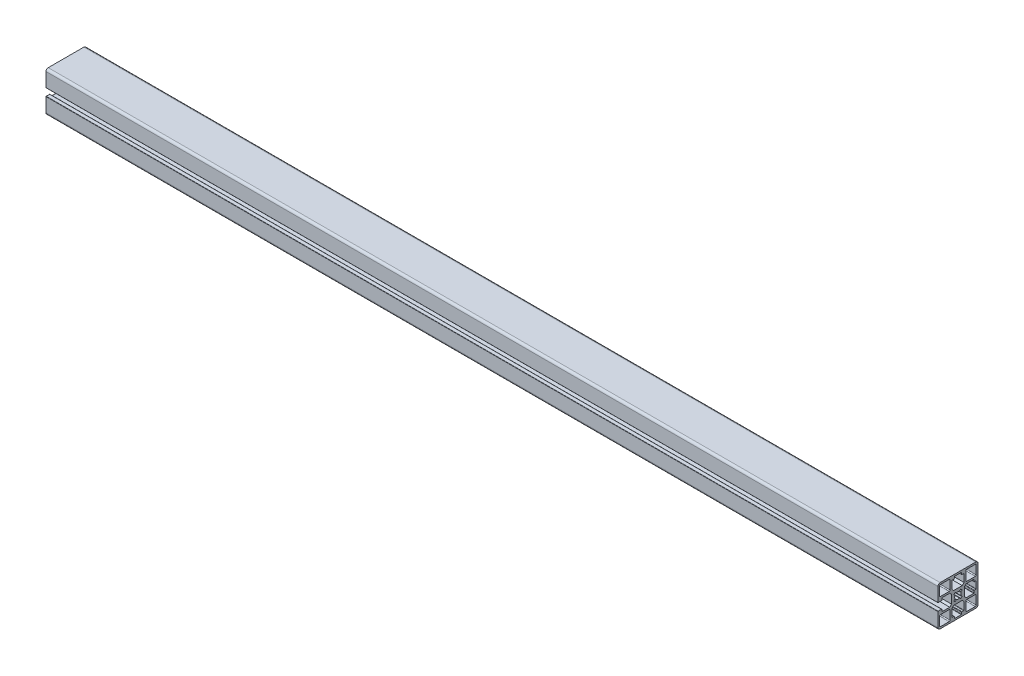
from build123d import *

# Parameters (mm, degrees)
F_45_SARJA_1_0174_45X45_L_3SS_VAHV_1_DEPTH = 1000


with BuildPart() as part:
    # Model → 45-sarja 1.0174 45X45 L 3SS VAHV_1 (new body)
    with BuildSketch(Plane(origin=(0, 0, 0), x_dir=(0, 0, 1), z_dir=(1, 0, 0))):
        with BuildLine():
            Line((-22.5, 20), (-22.5, 4.4))
            Line((-22.5, 4.4), (-22.5, -20))
            ThreePointArc((-22.5, -20), (-21.767766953, -21.767766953), (-20, -22.5))
            Line((-20, -22.5), (20, -22.5))
            ThreePointArc((20, -22.5), (21.767766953, -21.767766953), (22.5, -20))
            Line((22.5, -20), (22.5, -4.4))
            ThreePointArc((22.5, -4.4), (22.412132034, -4.187867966), (22.2, -4.1))
            Line((22.2, -4.1), (18.5, -4.1))
            ThreePointArc((18.5, -4.1), (18.146446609, -4.246446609), (18, -4.6))
            Line((18, -4.6), (18, -6.5))
            ThreePointArc((18, -6.5), (17.912132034, -6.712132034), (17.7, -6.8))
            Line((17.7, -6.8), (9.2, -6.8))
            Line((9.2, -6.8), (7.2, -4.8))
            Line((7.2, -4.8), (7.2, 4.8))
            Line((7.2, 4.8), (9.2, 6.8))
            Line((9.2, 6.8), (17.7, 6.8))
            ThreePointArc((17.7, 6.8), (17.912132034, 6.712132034), (18, 6.5))
            Line((18, 6.5), (18, 4.6))
            ThreePointArc((18, 4.6), (18.146446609, 4.246446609), (18.5, 4.1))
            Line((18.5, 4.1), (22.2, 4.1))
            ThreePointArc((22.2, 4.1), (22.412132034, 4.187867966), (22.5, 4.4))
            Line((22.5, 4.4), (22.5, 20))
            ThreePointArc((22.5, 20), (21.767766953, 21.767766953), (20, 22.5))
            Line((20, 22.5), (-20, 22.5))
            ThreePointArc((-20, 22.5), (-21.767766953, 21.767766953), (-22.5, 20))
        make_face()
        with BuildLine():
            Line((6.5, 18), (4.6, 18))
            ThreePointArc((4.6, 18), (4.246446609, 18.146446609), (4.1, 18.5))
            Line((4.1, 18.5), (4.1, 20.2))
            ThreePointArc((4.1, 20.2), (4.012132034, 20.412132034), (3.8, 20.5))
            Line((3.8, 20.5), (-3.8, 20.5))
            ThreePointArc((-3.8, 20.5), (-4.012132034, 20.412132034), (-4.1, 20.2))
            Line((-4.1, 20.2), (-4.1, 18.5))
            ThreePointArc((-4.1, 18.5), (-4.246446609, 18.146446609), (-4.6, 18))
            Line((-4.6, 18), (-6.5, 18))
            ThreePointArc((-6.5, 18), (-6.712132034, 17.912132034), (-6.8, 17.7))
            Line((-6.8, 17.7), (-6.8, 9.2))
            Line((-6.8, 9.2), (-4.8, 7.2))
            Line((-4.8, 7.2), (4.8, 7.2))
            Line((4.8, 7.2), (6.8, 9.2))
            Line((6.8, 9.2), (6.8, 17.7))
            ThreePointArc((6.8, 17.7), (6.712132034, 17.912132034), (6.5, 18))
        make_face(mode=Mode.SUBTRACT)
        with BuildLine():
            Line((-3.8, -20.5), (3.8, -20.5))
            ThreePointArc((3.8, -20.5), (4.012132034, -20.412132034), (4.1, -20.2))
            Line((4.1, -20.2), (4.1, -18.5))
            ThreePointArc((4.1, -18.5), (4.246446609, -18.146446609), (4.6, -18))
            Line((4.6, -18), (6.5, -18))
            ThreePointArc((6.5, -18), (6.712132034, -17.912132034), (6.8, -17.7))
            Line((6.8, -17.7), (6.8, -9.2))
            Line((6.8, -9.2), (4.8, -7.2))
            Line((4.8, -7.2), (-4.8, -7.2))
            Line((-4.8, -7.2), (-6.8, -9.2))
            Line((-6.8, -9.2), (-6.8, -17.7))
            ThreePointArc((-6.8, -17.7), (-6.712132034, -17.912132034), (-6.5, -18))
            Line((-6.5, -18), (-4.6, -18))
            ThreePointArc((-4.6, -18), (-4.246446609, -18.146446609), (-4.1, -18.5))
            Line((-4.1, -18.5), (-4.1, -20.2))
            ThreePointArc((-4.1, -20.2), (-4.012132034, -20.412132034), (-3.8, -20.5))
        make_face(mode=Mode.SUBTRACT)
        with BuildLine():
            Line((9.8, -20.5), (19.5, -20.5))
            ThreePointArc((19.5, -20.5), (20.207106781, -20.207106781), (20.5, -19.5))
            Line((20.5, -19.5), (20.5, -9.8))
            ThreePointArc((20.5, -9.8), (20.207106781, -9.092893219), (19.5, -8.8))
            Line((19.5, -8.8), (9.8, -8.8))
            ThreePointArc((9.8, -8.8), (9.092893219, -9.092893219), (8.8, -9.8))
            Line((8.8, -9.8), (8.8, -19.5))
            ThreePointArc((8.8, -19.5), (9.092893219, -20.207106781), (9.8, -20.5))
        make_face(mode=Mode.SUBTRACT)
        with BuildLine():
            Line((-20.5, -9.8), (-20.5, -19.5))
            ThreePointArc((-20.5, -19.5), (-20.207106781, -20.207106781), (-19.5, -20.5))
            Line((-19.5, -20.5), (-9.8, -20.5))
            ThreePointArc((-9.8, -20.5), (-9.092893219, -20.207106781), (-8.8, -19.5))
            Line((-8.8, -19.5), (-8.8, -9.8))
            ThreePointArc((-8.8, -9.8), (-9.092893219, -9.092893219), (-9.8, -8.8))
            Line((-9.8, -8.8), (-19.5, -8.8))
            ThreePointArc((-19.5, -8.8), (-20.207106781, -9.092893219), (-20.5, -9.8))
        make_face(mode=Mode.SUBTRACT)
        with BuildLine():
            Line((20.5, 9.8), (20.5, 19.5))
            ThreePointArc((20.5, 19.5), (20.207106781, 20.207106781), (19.5, 20.5))
            Line((19.5, 20.5), (9.8, 20.5))
            ThreePointArc((9.8, 20.5), (9.092893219, 20.207106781), (8.8, 19.5))
            Line((8.8, 19.5), (8.8, 9.8))
            ThreePointArc((8.8, 9.8), (9.092893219, 9.092893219), (9.8, 8.8))
            Line((9.8, 8.8), (19.5, 8.8))
            ThreePointArc((19.5, 8.8), (20.207106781, 9.092893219), (20.5, 9.8))
        make_face(mode=Mode.SUBTRACT)
        with BuildLine():
            Line((-9.8, 20.5), (-19.5, 20.5))
            ThreePointArc((-19.5, 20.5), (-20.207106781, 20.207106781), (-20.5, 19.5))
            Line((-20.5, 19.5), (-20.5, 9.8))
            ThreePointArc((-20.5, 9.8), (-20.207106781, 9.092893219), (-19.5, 8.8))
            Line((-19.5, 8.8), (-9.8, 8.8))
            ThreePointArc((-9.8, 8.8), (-9.092893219, 9.092893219), (-8.8, 9.8))
            Line((-8.8, 9.8), (-8.8, 19.5))
            ThreePointArc((-8.8, 19.5), (-9.092893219, 20.207106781), (-9.8, 20.5))
        make_face(mode=Mode.SUBTRACT)
        with BuildLine():
            Line((3.363290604, 1.949077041), (4.384062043, 2.969848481))
            ThreePointArc((4.384062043, 2.969848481), (4.471930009, 3.181980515), (4.384062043, 3.39411255))
            Line((4.384062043, 3.39411255), (3.39411255, 4.384062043))
            ThreePointArc((3.39411255, 4.384062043), (3.181980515, 4.471930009), (2.969848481, 4.384062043))
            Line((2.969848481, 4.384062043), (1.949077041, 3.363290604))
            ThreePointArc((1.949077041, 3.363290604), (1.786690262, 3.279575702), (1.605854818, 3.30557942))
            ThreePointArc((1.605854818, 3.30557942), (0, 3.675), (-1.605854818, 3.30557942))
            ThreePointArc((-1.605854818, 3.30557942), (-1.786690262, 3.279575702), (-1.949077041, 3.363290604))
            Line((-1.949077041, 3.363290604), (-2.969848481, 4.384062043))
            ThreePointArc((-2.969848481, 4.384062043), (-3.181980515, 4.471930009), (-3.39411255, 4.384062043))
            Line((-3.39411255, 4.384062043), (-4.384062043, 3.39411255))
            ThreePointArc((-4.384062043, 3.39411255), (-4.471930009, 3.181980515), (-4.384062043, 2.969848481))
            Line((-4.384062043, 2.969848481), (-3.363290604, 1.949077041))
            ThreePointArc((-3.363290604, 1.949077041), (-3.279575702, 1.786690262), (-3.30557942, 1.605854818))
            ThreePointArc((-3.30557942, 1.605854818), (-3.675, 0), (-3.30557942, -1.605854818))
            ThreePointArc((-3.30557942, -1.605854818), (-3.279575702, -1.786690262), (-3.363290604, -1.949077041))
            Line((-3.363290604, -1.949077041), (-4.384062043, -2.969848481))
            ThreePointArc((-4.384062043, -2.969848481), (-4.471930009, -3.181980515), (-4.384062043, -3.39411255))
            Line((-4.384062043, -3.39411255), (-3.39411255, -4.384062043))
            ThreePointArc((-3.39411255, -4.384062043), (-3.181980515, -4.471930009), (-2.969848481, -4.384062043))
            Line((-2.969848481, -4.384062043), (-1.949077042, -3.363290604))
            ThreePointArc((-1.949077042, -3.363290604), (-1.786690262, -3.279575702), (-1.605854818, -3.30557942))
            ThreePointArc((-1.605854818, -3.30557942), (0, -3.675), (1.605854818, -3.30557942))
            ThreePointArc((1.605854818, -3.30557942), (1.786690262, -3.279575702), (1.949077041, -3.363290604))
            Line((1.949077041, -3.363290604), (2.969848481, -4.384062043))
            ThreePointArc((2.969848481, -4.384062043), (3.181980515, -4.471930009), (3.39411255, -4.384062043))
            Line((3.39411255, -4.384062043), (4.384062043, -3.39411255))
            ThreePointArc((4.384062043, -3.39411255), (4.471930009, -3.181980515), (4.384062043, -2.969848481))
            Line((4.384062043, -2.969848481), (3.363290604, -1.949077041))
            ThreePointArc((3.363290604, -1.949077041), (3.279575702, -1.786690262), (3.30557942, -1.605854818))
            ThreePointArc((3.30557942, -1.605854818), (3.675, 0), (3.30557942, 1.605854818))
            ThreePointArc((3.30557942, 1.605854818), (3.279575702, 1.786690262), (3.363290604, 1.949077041))
        make_face(mode=Mode.SUBTRACT)
        with BuildLine():
            Line((-20.5, 3.8), (-20.5, -3.8))
            ThreePointArc((-20.5, -3.8), (-20.412132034, -4.012132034), (-20.2, -4.1))
            Line((-20.2, -4.1), (-18.5, -4.1))
            ThreePointArc((-18.5, -4.1), (-18.146446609, -4.246446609), (-18, -4.6))
            Line((-18, -4.6), (-18, -6.5))
            ThreePointArc((-18, -6.5), (-17.912132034, -6.712132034), (-17.7, -6.8))
            Line((-17.7, -6.8), (-9.2, -6.8))
            Line((-9.2, -6.8), (-7.2, -4.8))
            Line((-7.2, -4.8), (-7.2, 4.8))
            Line((-7.2, 4.8), (-9.2, 6.8))
            Line((-9.2, 6.8), (-17.7, 6.8))
            ThreePointArc((-17.7, 6.8), (-17.912132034, 6.712132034), (-18, 6.5))
            Line((-18, 6.5), (-18, 4.6))
            ThreePointArc((-18, 4.6), (-18.146446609, 4.246446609), (-18.5, 4.1))
            Line((-18.5, 4.1), (-20.2, 4.1))
            ThreePointArc((-20.2, 4.1), (-20.412132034, 4.012132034), (-20.5, 3.8))
        make_face(mode=Mode.SUBTRACT)
    extrude(amount=F_45_SARJA_1_0174_45X45_L_3SS_VAHV_1_DEPTH)


solid = part.part
